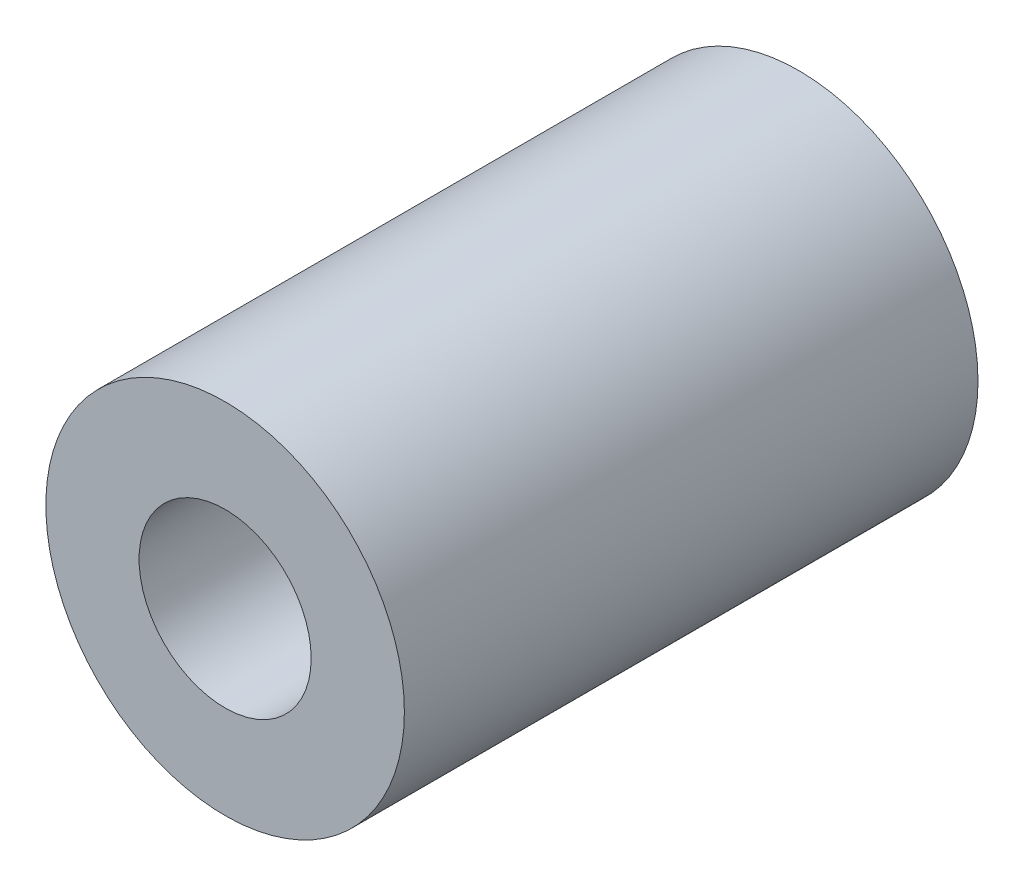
ISO-10303-21;
HEADER;
FILE_DESCRIPTION(('STEP AP214'),'2;1');
FILE_NAME('part.step','',(''),(''),'','','');
FILE_SCHEMA(('AUTOMOTIVE_DESIGN { 1 0 10303 214 1 1 1 1 }'));
ENDSEC;
DATA;
#1=APPLICATION_CONTEXT('core data for automotive mechanical design processes');
#2=APPLICATION_PROTOCOL_DEFINITION('international standard','automotive_design',2000,#1);
#3=PRODUCT_CONTEXT('',#1,'mechanical');
#4=PRODUCT('Part','Part','',(#3));
#5=PRODUCT_RELATED_PRODUCT_CATEGORY('part','',(#4));
#6=PRODUCT_DEFINITION_FORMATION('','',#4);
#7=PRODUCT_DEFINITION_CONTEXT('part definition',#1,'design');
#8=PRODUCT_DEFINITION('design','',#6,#7);
#9=PRODUCT_DEFINITION_SHAPE('','',#8);
#10=(LENGTH_UNIT() NAMED_UNIT(*) SI_UNIT(.MILLI.,.METRE.));
#11=(NAMED_UNIT(*) PLANE_ANGLE_UNIT() SI_UNIT($,.RADIAN.));
#12=(NAMED_UNIT(*) SI_UNIT($,.STERADIAN.) SOLID_ANGLE_UNIT());
#13=UNCERTAINTY_MEASURE_WITH_UNIT(LENGTH_MEASURE(1.E-05),#10,'distance_accuracy_value','');
#14=(GEOMETRIC_REPRESENTATION_CONTEXT(3) GLOBAL_UNCERTAINTY_ASSIGNED_CONTEXT((#13)) GLOBAL_UNIT_ASSIGNED_CONTEXT((#10,
#11,#12)) REPRESENTATION_CONTEXT('',''));
#15=CARTESIAN_POINT('',(0.,0.,0.));
#16=DIRECTION('',(0.,0.,1.));
#17=DIRECTION('',(1.,0.,0.));
#18=AXIS2_PLACEMENT_3D('',#15,#16,#17);
#19=CARTESIAN_POINT('',(4.00000000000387,0.,0.));
#20=DIRECTION('',(0.,0.,1.00000000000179));
#21=DIRECTION('',(1.00000000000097,0.,0.));
#22=AXIS2_PLACEMENT_3D('',#19,#20,#21);
#23=PLANE('',#22);
#24=CARTESIAN_POINT('',(0.,0.,0.));
#25=DIRECTION('',(0.,0.,1.00000000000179));
#26=DIRECTION('',(1.00000000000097,0.,0.));
#27=AXIS2_PLACEMENT_3D('',#24,#25,#26);
#28=CIRCLE('',#27,12.5);
#29=CARTESIAN_POINT('',(12.5000000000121,0.,0.));
#30=VERTEX_POINT('',#29);
#31=EDGE_CURVE('E9',#30,#30,#28,.T.);
#32=ORIENTED_EDGE('',*,*,#31,.F.);
#33=EDGE_LOOP('',(#32));
#34=FACE_BOUND('',#33,.T.);
#35=ADVANCED_FACE('F13',(#34),#23,.F.);
#36=CARTESIAN_POINT('',(0.,0.,40.0000000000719));
#37=DIRECTION('',(0.,0.,1.00000000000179));
#38=DIRECTION('',(1.00000000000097,0.,0.));
#39=AXIS2_PLACEMENT_3D('',#36,#37,#38);
#40=CYLINDRICAL_SURFACE('',#39,12.5);
#41=CARTESIAN_POINT('',(0.,0.,40.0000000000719));
#42=DIRECTION('',(0.,0.,1.00000000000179));
#43=DIRECTION('',(1.00000000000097,0.,0.));
#44=AXIS2_PLACEMENT_3D('',#41,#42,#43);
#45=CIRCLE('',#44,12.5);
#46=CARTESIAN_POINT('',(12.5000000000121,0.,40.0000000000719));
#47=VERTEX_POINT('',#46);
#48=EDGE_CURVE('E19',#47,#47,#45,.T.);
#49=ORIENTED_EDGE('',*,*,#48,.F.);
#50=EDGE_LOOP('',(#49));
#51=FACE_BOUND('',#50,.T.);
#52=ORIENTED_EDGE('',*,*,#31,.T.);
#53=EDGE_LOOP('',(#52));
#54=FACE_BOUND('',#53,.T.);
#55=ADVANCED_FACE('F43',(#51,#54),#40,.T.);
#56=CARTESIAN_POINT('',(12.500000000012,0.,40.0000000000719));
#57=DIRECTION('',(0.,0.,-1.00000000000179));
#58=DIRECTION('',(-1.00000000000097,0.,0.));
#59=AXIS2_PLACEMENT_3D('',#56,#57,#58);
#60=PLANE('',#59);
#61=CARTESIAN_POINT('',(0.,0.,40.0000000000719));
#62=DIRECTION('',(0.,0.,1.00000000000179));
#63=DIRECTION('',(1.00000000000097,0.,0.));
#64=AXIS2_PLACEMENT_3D('',#61,#62,#63);
#65=CIRCLE('',#64,6.);
#66=CARTESIAN_POINT('',(6.00000000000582,0.,40.0000000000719));
#67=VERTEX_POINT('',#66);
#68=EDGE_CURVE('E23',#67,#67,#65,.T.);
#69=ORIENTED_EDGE('',*,*,#68,.F.);
#70=EDGE_LOOP('',(#69));
#71=FACE_BOUND('',#70,.T.);
#72=ORIENTED_EDGE('',*,*,#48,.T.);
#73=EDGE_LOOP('',(#72));
#74=FACE_BOUND('',#73,.T.);
#75=ADVANCED_FACE('F38',(#71,#74),#60,.F.);
#76=CARTESIAN_POINT('',(0.,0.,40.0000000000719));
#77=DIRECTION('',(0.,0.,1.00000000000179));
#78=DIRECTION('',(1.00000000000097,0.,0.));
#79=AXIS2_PLACEMENT_3D('',#76,#77,#78);
#80=CYLINDRICAL_SURFACE('',#79,6.);
#81=CARTESIAN_POINT('',(0.,0.,20.0000000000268));
#82=DIRECTION('',(0.,0.,1.));
#83=DIRECTION('',(1.,0.,0.));
#84=AXIS2_PLACEMENT_3D('',#81,#82,#83);
#85=CIRCLE('',#84,6.00000000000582);
#86=CARTESIAN_POINT('',(6.00000000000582,0.,20.0000000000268));
#87=VERTEX_POINT('',#86);
#88=EDGE_CURVE('E27',#87,#87,#85,.T.);
#89=ORIENTED_EDGE('',*,*,#88,.F.);
#90=EDGE_LOOP('',(#89));
#91=FACE_BOUND('',#90,.T.);
#92=ORIENTED_EDGE('',*,*,#68,.T.);
#93=EDGE_LOOP('',(#92));
#94=FACE_BOUND('',#93,.T.);
#95=ADVANCED_FACE('F35',(#91,#94),#80,.F.);
#96=CARTESIAN_POINT('',(0.,0.,20.0000000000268));
#97=DIRECTION('',(0.,0.,1.));
#98=DIRECTION('',(1.,0.,0.));
#99=AXIS2_PLACEMENT_3D('',#96,#97,#98);
#100=PLANE('',#99);
#101=ORIENTED_EDGE('',*,*,#88,.T.);
#102=EDGE_LOOP('',(#101));
#103=FACE_BOUND('',#102,.T.);
#104=ADVANCED_FACE('F33',(#103),#100,.T.);
#105=CLOSED_SHELL('',(#35,#55,#75,#95,#104));
#106=MANIFOLD_SOLID_BREP('B1',#105);
#107=ADVANCED_BREP_SHAPE_REPRESENTATION('',(#18,#106),#14);
#108=SHAPE_DEFINITION_REPRESENTATION(#9,#107);
ENDSEC;
END-ISO-10303-21;
